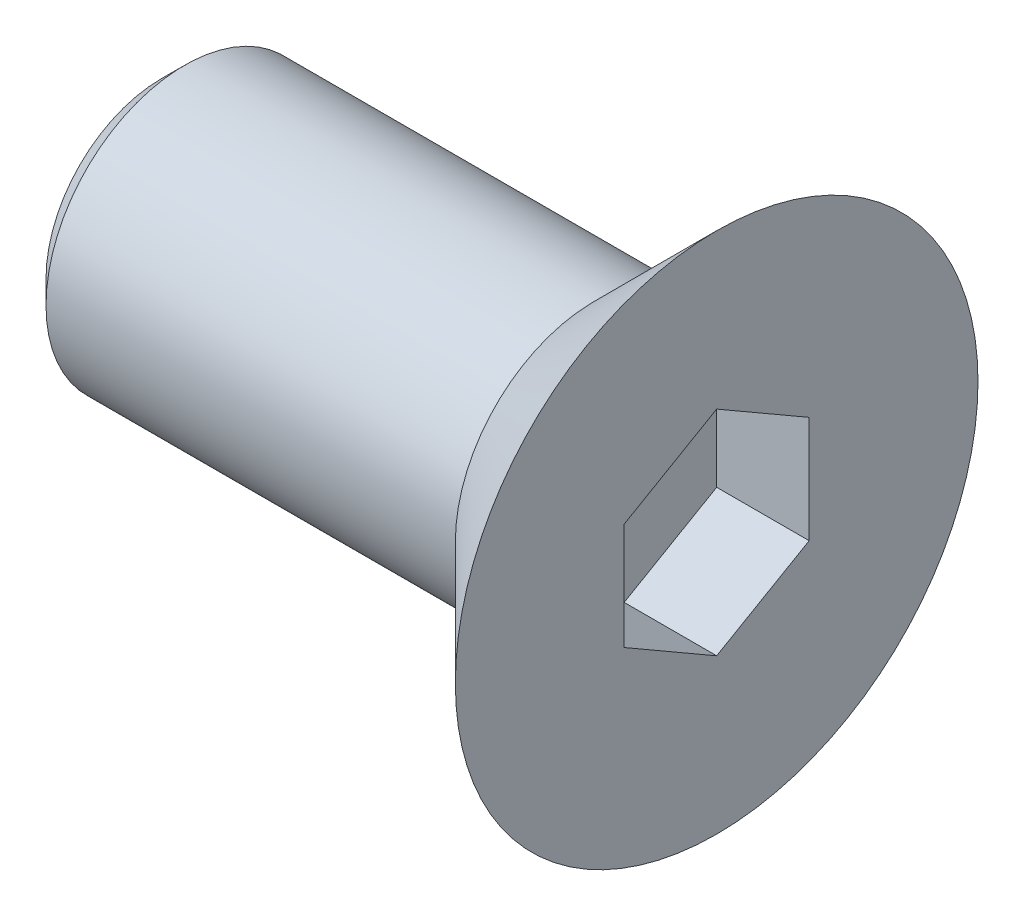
ISO-10303-21;
HEADER;
FILE_DESCRIPTION(('STEP AP214'),'2;1');
FILE_NAME('part.step','',(''),(''),'','','');
FILE_SCHEMA(('AUTOMOTIVE_DESIGN { 1 0 10303 214 1 1 1 1 }'));
ENDSEC;
DATA;
#1=APPLICATION_CONTEXT('core data for automotive mechanical design processes');
#2=APPLICATION_PROTOCOL_DEFINITION('international standard','automotive_design',2000,#1);
#3=PRODUCT_CONTEXT('',#1,'mechanical');
#4=PRODUCT('Part','Part','',(#3));
#5=PRODUCT_RELATED_PRODUCT_CATEGORY('part','',(#4));
#6=PRODUCT_DEFINITION_FORMATION('','',#4);
#7=PRODUCT_DEFINITION_CONTEXT('part definition',#1,'design');
#8=PRODUCT_DEFINITION('design','',#6,#7);
#9=PRODUCT_DEFINITION_SHAPE('','',#8);
#10=(LENGTH_UNIT() NAMED_UNIT(*) SI_UNIT(.MILLI.,.METRE.));
#11=(NAMED_UNIT(*) PLANE_ANGLE_UNIT() SI_UNIT($,.RADIAN.));
#12=(NAMED_UNIT(*) SI_UNIT($,.STERADIAN.) SOLID_ANGLE_UNIT());
#13=UNCERTAINTY_MEASURE_WITH_UNIT(LENGTH_MEASURE(1.E-05),#10,'distance_accuracy_value','');
#14=(GEOMETRIC_REPRESENTATION_CONTEXT(3) GLOBAL_UNCERTAINTY_ASSIGNED_CONTEXT((#13)) GLOBAL_UNIT_ASSIGNED_CONTEXT((#10,
#11,#12)) REPRESENTATION_CONTEXT('',''));
#15=CARTESIAN_POINT('',(0.,0.,0.));
#16=DIRECTION('',(0.,0.,1.));
#17=DIRECTION('',(1.,0.,0.));
#18=AXIS2_PLACEMENT_3D('',#15,#16,#17);
#19=CARTESIAN_POINT('',(-2.74587256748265,0.,0.));
#20=DIRECTION('',(-1.,0.,0.));
#21=DIRECTION('',(0.,0.,1.));
#22=AXIS2_PLACEMENT_3D('',#19,#20,#21);
#23=PLANE('',#22);
#24=DIRECTION('',(0.,1.,0.));
#25=VECTOR('',#24,1.);
#26=CARTESIAN_POINT('',(-2.74587256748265,-1.15470053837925,-2.));
#27=LINE('',#26,#25);
#28=CARTESIAN_POINT('',(-2.74587256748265,-1.15470053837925,-2.));
#29=VERTEX_POINT('',#28);
#30=CARTESIAN_POINT('',(-2.74587256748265,1.15470053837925,-2.));
#31=VERTEX_POINT('',#30);
#32=EDGE_CURVE('E100',#29,#31,#27,.T.);
#33=ORIENTED_EDGE('',*,*,#32,.F.);
#34=DIRECTION('',(0.,0.5,-0.866025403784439));
#35=VECTOR('',#34,1.);
#36=CARTESIAN_POINT('',(-2.74587256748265,-2.3094010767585,0.));
#37=LINE('',#36,#35);
#38=CARTESIAN_POINT('',(-2.74587256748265,-2.3094010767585,0.));
#39=VERTEX_POINT('',#38);
#40=EDGE_CURVE('E46',#39,#29,#37,.T.);
#41=ORIENTED_EDGE('',*,*,#40,.F.);
#42=DIRECTION('',(0.,-0.5,-0.866025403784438));
#43=VECTOR('',#42,1.);
#44=CARTESIAN_POINT('',(-2.74587256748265,-1.15470053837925,2.));
#45=LINE('',#44,#43);
#46=CARTESIAN_POINT('',(-2.74587256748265,-1.15470053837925,2.));
#47=VERTEX_POINT('',#46);
#48=EDGE_CURVE('E115',#47,#39,#45,.T.);
#49=ORIENTED_EDGE('',*,*,#48,.F.);
#50=DIRECTION('',(0.,-1.,0.));
#51=VECTOR('',#50,1.);
#52=CARTESIAN_POINT('',(-2.74587256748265,1.15470053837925,2.));
#53=LINE('',#52,#51);
#54=CARTESIAN_POINT('',(-2.74587256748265,1.15470053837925,2.));
#55=VERTEX_POINT('',#54);
#56=EDGE_CURVE('E109',#55,#47,#53,.T.);
#57=ORIENTED_EDGE('',*,*,#56,.F.);
#58=DIRECTION('',(0.,-0.5,0.866025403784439));
#59=VECTOR('',#58,1.);
#60=CARTESIAN_POINT('',(-2.74587256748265,2.3094010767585,0.));
#61=LINE('',#60,#59);
#62=CARTESIAN_POINT('',(-2.74587256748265,2.3094010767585,0.));
#63=VERTEX_POINT('',#62);
#64=EDGE_CURVE('E107',#63,#55,#61,.T.);
#65=ORIENTED_EDGE('',*,*,#64,.F.);
#66=DIRECTION('',(0.,0.5,0.866025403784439));
#67=VECTOR('',#66,1.);
#68=CARTESIAN_POINT('',(-2.74587256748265,1.15470053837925,-2.));
#69=LINE('',#68,#67);
#70=EDGE_CURVE('E89',#31,#63,#69,.T.);
#71=ORIENTED_EDGE('',*,*,#70,.F.);
#72=EDGE_LOOP('',(#33,#41,#49,#57,#65,#71));
#73=FACE_BOUND('',#72,.T.);
#74=CARTESIAN_POINT('',(-2.74587256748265,0.,0.));
#75=DIRECTION('',(-1.,0.,0.));
#76=DIRECTION('',(0.,0.,1.));
#77=AXIS2_PLACEMENT_3D('',#74,#75,#76);
#78=CIRCLE('',#77,5.65);
#79=CARTESIAN_POINT('',(-2.74587256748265,0.,5.65));
#80=VERTEX_POINT('',#79);
#81=EDGE_CURVE('E142',#80,#80,#78,.T.);
#82=ORIENTED_EDGE('',*,*,#81,.F.);
#83=EDGE_LOOP('',(#82));
#84=FACE_BOUND('',#83,.T.);
#85=ADVANCED_FACE('F32',(#73,#84),#23,.F.);
#86=CARTESIAN_POINT('',(-2.74587256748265,0.,0.));
#87=DIRECTION('',(1.,0.,0.));
#88=DIRECTION('',(0.,0.,-1.));
#89=AXIS2_PLACEMENT_3D('',#86,#87,#88);
#90=CONICAL_SURFACE('',#89,5.65,0.785398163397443);
#91=CARTESIAN_POINT('',(-5.39587256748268,0.,0.));
#92=DIRECTION('',(-1.,0.,0.));
#93=DIRECTION('',(0.,0.,1.));
#94=AXIS2_PLACEMENT_3D('',#91,#92,#93);
#95=CIRCLE('',#94,3.);
#96=CARTESIAN_POINT('',(-5.39587256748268,0.,3.));
#97=VERTEX_POINT('',#96);
#98=EDGE_CURVE('E133',#97,#97,#95,.T.);
#99=ORIENTED_EDGE('',*,*,#98,.F.);
#100=EDGE_LOOP('',(#99));
#101=FACE_BOUND('',#100,.T.);
#102=ORIENTED_EDGE('',*,*,#81,.T.);
#103=EDGE_LOOP('',(#102));
#104=FACE_BOUND('',#103,.T.);
#105=ADVANCED_FACE('F165',(#101,#104),#90,.T.);
#106=CARTESIAN_POINT('',(-18.7903327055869,0.,0.));
#107=DIRECTION('',(-1.,0.,0.));
#108=DIRECTION('',(0.,0.,1.));
#109=AXIS2_PLACEMENT_3D('',#106,#107,#108);
#110=CYLINDRICAL_SURFACE('',#109,3.);
#111=CARTESIAN_POINT('',(-14.2458725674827,0.,0.));
#112=DIRECTION('',(1.,0.,0.));
#113=DIRECTION('',(0.,0.,-1.));
#114=AXIS2_PLACEMENT_3D('',#111,#112,#113);
#115=CIRCLE('',#114,3.);
#116=CARTESIAN_POINT('',(-14.2458725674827,0.,-3.));
#117=VERTEX_POINT('',#116);
#118=EDGE_CURVE('E11',#117,#117,#115,.T.);
#119=ORIENTED_EDGE('',*,*,#118,.T.);
#120=EDGE_LOOP('',(#119));
#121=FACE_BOUND('',#120,.T.);
#122=ORIENTED_EDGE('',*,*,#98,.T.);
#123=EDGE_LOOP('',(#122));
#124=FACE_BOUND('',#123,.T.);
#125=ADVANCED_FACE('F161',(#121,#124),#110,.T.);
#126=CARTESIAN_POINT('',(-14.7458725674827,3.,0.));
#127=DIRECTION('',(1.,0.,0.));
#128=DIRECTION('',(0.,0.,-1.));
#129=AXIS2_PLACEMENT_3D('',#126,#127,#128);
#130=PLANE('',#129);
#131=CARTESIAN_POINT('',(-14.7458725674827,0.,0.));
#132=DIRECTION('',(1.,0.,0.));
#133=DIRECTION('',(0.,0.,-1.));
#134=AXIS2_PLACEMENT_3D('',#131,#132,#133);
#135=CIRCLE('',#134,2.5);
#136=CARTESIAN_POINT('',(-14.7458725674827,0.,-2.5));
#137=VERTEX_POINT('',#136);
#138=EDGE_CURVE('E39',#137,#137,#135,.F.);
#139=ORIENTED_EDGE('',*,*,#138,.T.);
#140=EDGE_LOOP('',(#139));
#141=FACE_BOUND('',#140,.T.);
#142=ADVANCED_FACE('F148',(#141),#130,.F.);
#143=CARTESIAN_POINT('',(-14.7458725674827,0.,0.));
#144=DIRECTION('',(1.,0.,0.));
#145=DIRECTION('',(0.,0.,-1.));
#146=AXIS2_PLACEMENT_3D('',#143,#144,#145);
#147=CONICAL_SURFACE('',#146,2.5,0.78539816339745);
#148=ORIENTED_EDGE('',*,*,#118,.F.);
#149=EDGE_LOOP('',(#148));
#150=FACE_BOUND('',#149,.T.);
#151=ORIENTED_EDGE('',*,*,#138,.F.);
#152=EDGE_LOOP('',(#151));
#153=FACE_BOUND('',#152,.T.);
#154=ADVANCED_FACE('F150',(#150,#153),#147,.T.);
#155=CARTESIAN_POINT('',(-4.74587256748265,-2.3094010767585,0.));
#156=DIRECTION('',(0.,-0.866025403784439,-0.5));
#157=DIRECTION('',(0.,0.5,-0.866025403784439));
#158=AXIS2_PLACEMENT_3D('',#155,#156,#157);
#159=PLANE('',#158);
#160=ORIENTED_EDGE('',*,*,#40,.T.);
#161=DIRECTION('',(1.,0.,0.));
#162=VECTOR('',#161,1.);
#163=CARTESIAN_POINT('',(-4.74587256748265,-1.15470053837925,-2.));
#164=LINE('',#163,#162);
#165=CARTESIAN_POINT('',(-4.74587256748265,-1.15470053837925,-2.));
#166=VERTEX_POINT('',#165);
#167=EDGE_CURVE('E97',#166,#29,#164,.T.);
#168=ORIENTED_EDGE('',*,*,#167,.F.);
#169=DIRECTION('',(0.,0.5,-0.866025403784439));
#170=VECTOR('',#169,1.);
#171=CARTESIAN_POINT('',(-4.74587256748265,-2.3094010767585,0.));
#172=LINE('',#171,#170);
#173=CARTESIAN_POINT('',(-4.74587256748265,-2.3094010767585,0.));
#174=VERTEX_POINT('',#173);
#175=EDGE_CURVE('E117',#174,#166,#172,.T.);
#176=ORIENTED_EDGE('',*,*,#175,.F.);
#177=DIRECTION('',(1.,0.,0.));
#178=VECTOR('',#177,1.);
#179=CARTESIAN_POINT('',(-4.74587256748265,-2.3094010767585,0.));
#180=LINE('',#179,#178);
#181=EDGE_CURVE('E53',#174,#39,#180,.T.);
#182=ORIENTED_EDGE('',*,*,#181,.T.);
#183=EDGE_LOOP('',(#160,#168,#176,#182));
#184=FACE_BOUND('',#183,.T.);
#185=ADVANCED_FACE('F152',(#184),#159,.F.);
#186=CARTESIAN_POINT('',(-4.74587256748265,-1.15470053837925,2.));
#187=DIRECTION('',(0.,-0.866025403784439,0.5));
#188=DIRECTION('',(0.,-0.5,-0.866025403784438));
#189=AXIS2_PLACEMENT_3D('',#186,#187,#188);
#190=PLANE('',#189);
#191=ORIENTED_EDGE('',*,*,#48,.T.);
#192=ORIENTED_EDGE('',*,*,#181,.F.);
#193=DIRECTION('',(0.,-0.5,-0.866025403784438));
#194=VECTOR('',#193,1.);
#195=CARTESIAN_POINT('',(-4.74587256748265,-1.15470053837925,2.));
#196=LINE('',#195,#194);
#197=CARTESIAN_POINT('',(-4.74587256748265,-1.15470053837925,2.));
#198=VERTEX_POINT('',#197);
#199=EDGE_CURVE('E129',#198,#174,#196,.T.);
#200=ORIENTED_EDGE('',*,*,#199,.F.);
#201=DIRECTION('',(1.,0.,0.));
#202=VECTOR('',#201,1.);
#203=CARTESIAN_POINT('',(-4.74587256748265,-1.15470053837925,2.));
#204=LINE('',#203,#202);
#205=EDGE_CURVE('E134',#198,#47,#204,.T.);
#206=ORIENTED_EDGE('',*,*,#205,.T.);
#207=EDGE_LOOP('',(#191,#192,#200,#206));
#208=FACE_BOUND('',#207,.T.);
#209=ADVANCED_FACE('F159',(#208),#190,.F.);
#210=CARTESIAN_POINT('',(-4.74587256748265,1.15470053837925,2.));
#211=DIRECTION('',(0.,0.,1.));
#212=DIRECTION('',(1.,0.,0.));
#213=AXIS2_PLACEMENT_3D('',#210,#211,#212);
#214=PLANE('',#213);
#215=ORIENTED_EDGE('',*,*,#56,.T.);
#216=ORIENTED_EDGE('',*,*,#205,.F.);
#217=DIRECTION('',(0.,-1.,0.));
#218=VECTOR('',#217,1.);
#219=CARTESIAN_POINT('',(-4.74587256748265,1.15470053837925,2.));
#220=LINE('',#219,#218);
#221=CARTESIAN_POINT('',(-4.74587256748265,1.15470053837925,2.));
#222=VERTEX_POINT('',#221);
#223=EDGE_CURVE('E126',#222,#198,#220,.T.);
#224=ORIENTED_EDGE('',*,*,#223,.F.);
#225=DIRECTION('',(1.,0.,0.));
#226=VECTOR('',#225,1.);
#227=CARTESIAN_POINT('',(-4.74587256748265,1.15470053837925,2.));
#228=LINE('',#227,#226);
#229=EDGE_CURVE('E136',#222,#55,#228,.T.);
#230=ORIENTED_EDGE('',*,*,#229,.T.);
#231=EDGE_LOOP('',(#215,#216,#224,#230));
#232=FACE_BOUND('',#231,.T.);
#233=ADVANCED_FACE('F209',(#232),#214,.F.);
#234=CARTESIAN_POINT('',(-4.74587256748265,2.3094010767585,0.));
#235=DIRECTION('',(0.,0.866025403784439,0.5));
#236=DIRECTION('',(0.,-0.5,0.866025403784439));
#237=AXIS2_PLACEMENT_3D('',#234,#235,#236);
#238=PLANE('',#237);
#239=ORIENTED_EDGE('',*,*,#64,.T.);
#240=ORIENTED_EDGE('',*,*,#229,.F.);
#241=DIRECTION('',(0.,-0.5,0.866025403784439));
#242=VECTOR('',#241,1.);
#243=CARTESIAN_POINT('',(-4.74587256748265,2.3094010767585,0.));
#244=LINE('',#243,#242);
#245=CARTESIAN_POINT('',(-4.74587256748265,2.3094010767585,0.));
#246=VERTEX_POINT('',#245);
#247=EDGE_CURVE('E123',#246,#222,#244,.T.);
#248=ORIENTED_EDGE('',*,*,#247,.F.);
#249=DIRECTION('',(1.,0.,0.));
#250=VECTOR('',#249,1.);
#251=CARTESIAN_POINT('',(-4.74587256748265,2.3094010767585,0.));
#252=LINE('',#251,#250);
#253=EDGE_CURVE('E96',#246,#63,#252,.T.);
#254=ORIENTED_EDGE('',*,*,#253,.T.);
#255=EDGE_LOOP('',(#239,#240,#248,#254));
#256=FACE_BOUND('',#255,.T.);
#257=ADVANCED_FACE('F218',(#256),#238,.F.);
#258=CARTESIAN_POINT('',(-4.74587256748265,1.15470053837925,-2.));
#259=DIRECTION('',(0.,0.866025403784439,-0.5));
#260=DIRECTION('',(0.,0.5,0.866025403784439));
#261=AXIS2_PLACEMENT_3D('',#258,#259,#260);
#262=PLANE('',#261);
#263=ORIENTED_EDGE('',*,*,#70,.T.);
#264=ORIENTED_EDGE('',*,*,#253,.F.);
#265=DIRECTION('',(0.,0.5,0.866025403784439));
#266=VECTOR('',#265,1.);
#267=CARTESIAN_POINT('',(-4.74587256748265,1.15470053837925,-2.));
#268=LINE('',#267,#266);
#269=CARTESIAN_POINT('',(-4.74587256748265,1.15470053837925,-2.));
#270=VERTEX_POINT('',#269);
#271=EDGE_CURVE('E92',#270,#246,#268,.T.);
#272=ORIENTED_EDGE('',*,*,#271,.F.);
#273=DIRECTION('',(1.,0.,0.));
#274=VECTOR('',#273,1.);
#275=CARTESIAN_POINT('',(-4.74587256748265,1.15470053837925,-2.));
#276=LINE('',#275,#274);
#277=EDGE_CURVE('E85',#270,#31,#276,.T.);
#278=ORIENTED_EDGE('',*,*,#277,.T.);
#279=EDGE_LOOP('',(#263,#264,#272,#278));
#280=FACE_BOUND('',#279,.T.);
#281=ADVANCED_FACE('F87',(#280),#262,.F.);
#282=CARTESIAN_POINT('',(-4.74587256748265,-1.15470053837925,-2.));
#283=DIRECTION('',(0.,0.,-1.));
#284=DIRECTION('',(-1.,0.,0.));
#285=AXIS2_PLACEMENT_3D('',#282,#283,#284);
#286=PLANE('',#285);
#287=ORIENTED_EDGE('',*,*,#32,.T.);
#288=ORIENTED_EDGE('',*,*,#277,.F.);
#289=DIRECTION('',(0.,1.,0.));
#290=VECTOR('',#289,1.);
#291=CARTESIAN_POINT('',(-4.74587256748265,-1.15470053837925,-2.));
#292=LINE('',#291,#290);
#293=EDGE_CURVE('E120',#166,#270,#292,.T.);
#294=ORIENTED_EDGE('',*,*,#293,.F.);
#295=ORIENTED_EDGE('',*,*,#167,.T.);
#296=EDGE_LOOP('',(#287,#288,#294,#295));
#297=FACE_BOUND('',#296,.T.);
#298=ADVANCED_FACE('F101',(#297),#286,.F.);
#299=CARTESIAN_POINT('',(-4.74587256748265,-3.46410161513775,2.));
#300=DIRECTION('',(-1.,0.,0.));
#301=DIRECTION('',(0.,0.,1.));
#302=AXIS2_PLACEMENT_3D('',#299,#300,#301);
#303=PLANE('',#302);
#304=ORIENTED_EDGE('',*,*,#175,.T.);
#305=ORIENTED_EDGE('',*,*,#293,.T.);
#306=ORIENTED_EDGE('',*,*,#271,.T.);
#307=ORIENTED_EDGE('',*,*,#247,.T.);
#308=ORIENTED_EDGE('',*,*,#223,.T.);
#309=ORIENTED_EDGE('',*,*,#199,.T.);
#310=EDGE_LOOP('',(#304,#305,#306,#307,#308,#309));
#311=FACE_BOUND('',#310,.T.);
#312=ADVANCED_FACE('F245',(#311),#303,.F.);
#313=CLOSED_SHELL('',(#85,#105,#125,#142,#154,#185,#209,#233,#257,#281,#298,#312));
#314=MANIFOLD_SOLID_BREP('B2',#313);
#315=ADVANCED_BREP_SHAPE_REPRESENTATION('',(#18,#314),#14);
#316=SHAPE_DEFINITION_REPRESENTATION(#9,#315);
ENDSEC;
END-ISO-10303-21;
